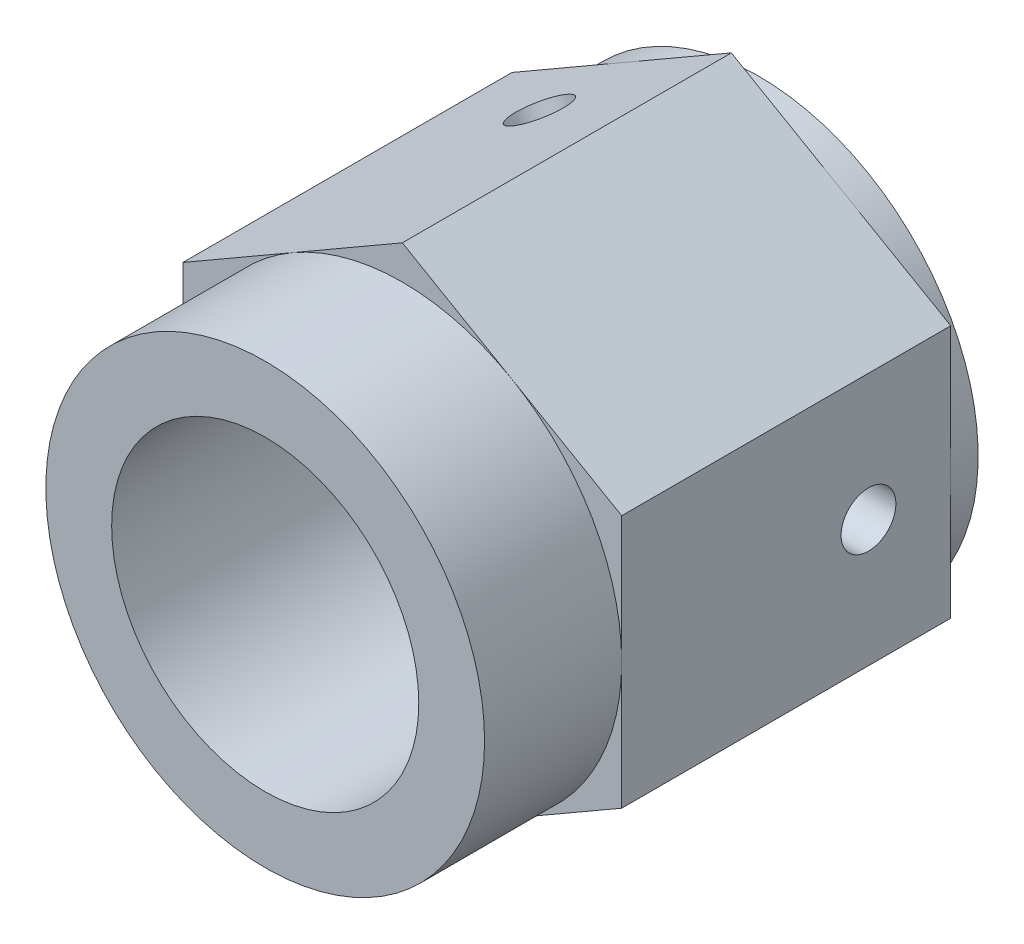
from build123d import *

# Parameters (mm, degrees)
EXTRUDE_1_DEPTH     = 60
SKETCH_2_R          = 40
EXTRUDE_2_DEPTH     = 25
EXTRUDE_START       = 5
SKETCH_3_R          = 40
EXTRUDE_3_DEPTH     = 5
SKETCH_4_R          = 15
CUT_EXTRUDE_1_DEPTH = 45
SKETCH_5_R          = 28
CUT_EXTRUDE_2_DEPTH = 45
SKETCH_6_R          = 5
CUT_EXTRUDE_3_DEPTH = 30
SKETCH_7_R          = 5
CUT_EXTRUDE_4_DEPTH = 30
SKETCH_8_R          = 5
CUT_EXTRUDE_5_DEPTH = 30


with BuildPart() as part:
    # Sketch 1 → Extrude 1 (new body)
    with BuildSketch(Plane.XY):
        Polygon((0, 46.188021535), (-40, 23.094010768), (-40, -23.094010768), (0, -46.188021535), (40, -23.094010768), (40, 23.094010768), align=None)
    extrude(amount=EXTRUDE_1_DEPTH)

    # Sketch 2 → Extrude 2 (add)
    with BuildSketch(Plane.XY.offset(60)):
        Circle(SKETCH_2_R)
    extrude(amount=EXTRUDE_2_DEPTH)

    # Sketch 3 → Extrude 3 (add)
    with BuildSketch(Plane(origin=(0, 0, 0), x_dir=(-1, 0, 0), z_dir=(0, 0, -1)).offset(EXTRUDE_START)):
        with Locations(Location((0, 0, 0), (0, 0, 180))):
            Circle(SKETCH_3_R)
    extrude(amount=-EXTRUDE_3_DEPTH)

    # Sketch 4 → Cut-Extrude 1 (cut)
    with BuildSketch(Plane(origin=(0, 0, -5), x_dir=(-1, 0, 0), z_dir=(0, 0, -1))):
        Circle(SKETCH_4_R)
    extrude(amount=-CUT_EXTRUDE_1_DEPTH, mode=Mode.SUBTRACT)

    # Sketch 5 → Cut-Extrude 2 (cut)
    with BuildSketch(Plane.XY.offset(85)):
        Circle(SKETCH_5_R)
    extrude(amount=-CUT_EXTRUDE_2_DEPTH, mode=Mode.SUBTRACT)

    # Sketch 6 → Cut-Extrude 3 (cut)
    with BuildSketch(Plane(origin=(-20, 34.641016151, 0), x_dir=(0.8660254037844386, 0.5000000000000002, 0), z_dir=(-0.5000000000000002, 0.8660254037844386, 0))):
        with Locations(Location((0, -15, 0), (0, 0, 180))):
            Circle(SKETCH_6_R)
    extrude(amount=-CUT_EXTRUDE_3_DEPTH, mode=Mode.SUBTRACT)

    # Sketch 7 → Cut-Extrude 4 (cut)
    with BuildSketch(Plane(origin=(-20, -34.641016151, 0), x_dir=(0.8660254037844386, -0.5000000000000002, 0), z_dir=(-0.5000000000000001, -0.8660254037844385, 0))):
        with Locations((0, 15)):
            Circle(SKETCH_7_R)
    extrude(amount=-CUT_EXTRUDE_4_DEPTH, mode=Mode.SUBTRACT)

    # Sketch 8 → Cut-Extrude 5 (cut)
    with BuildSketch(Plane(origin=(40, 0, 0), x_dir=(0, 0, -1), z_dir=(1, 0, 0))):
        with Locations((-15, 0)):
            Circle(SKETCH_8_R)
    extrude(amount=-CUT_EXTRUDE_5_DEPTH, mode=Mode.SUBTRACT)


solid = part.part
